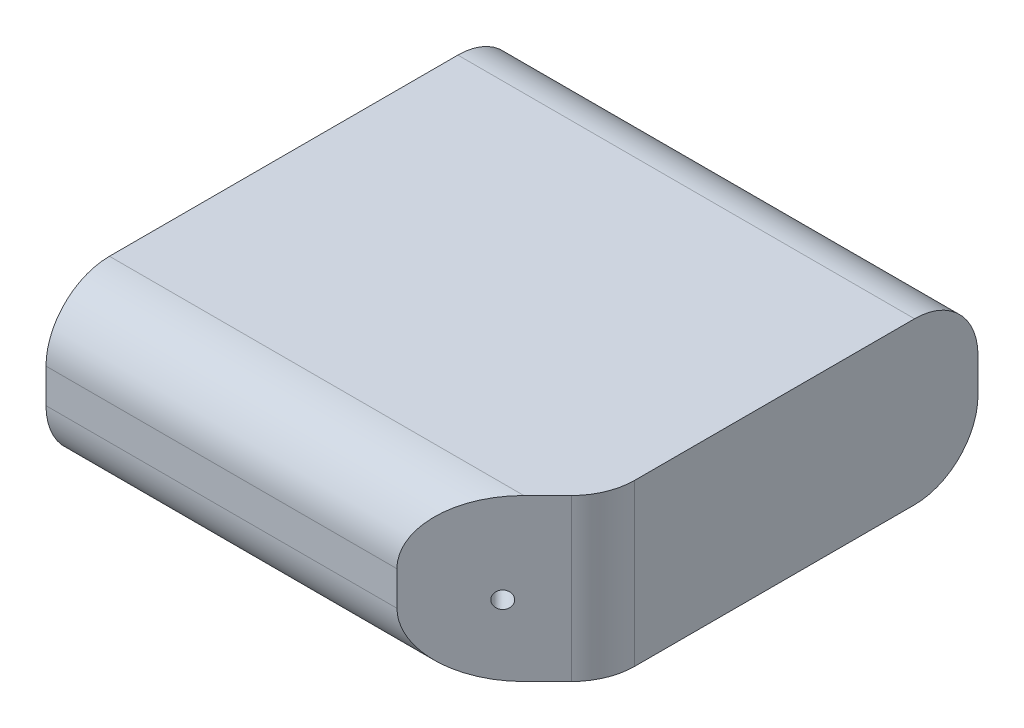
ISO-10303-21;
HEADER;
FILE_DESCRIPTION(('STEP AP214'),'2;1');
FILE_NAME('part.step','',(''),(''),'','','');
FILE_SCHEMA(('AUTOMOTIVE_DESIGN { 1 0 10303 214 1 1 1 1 }'));
ENDSEC;
DATA;
#1=APPLICATION_CONTEXT('core data for automotive mechanical design processes');
#2=APPLICATION_PROTOCOL_DEFINITION('international standard','automotive_design',2000,#1);
#3=PRODUCT_CONTEXT('',#1,'mechanical');
#4=PRODUCT('Part','Part','',(#3));
#5=PRODUCT_RELATED_PRODUCT_CATEGORY('part','',(#4));
#6=PRODUCT_DEFINITION_FORMATION('','',#4);
#7=PRODUCT_DEFINITION_CONTEXT('part definition',#1,'design');
#8=PRODUCT_DEFINITION('design','',#6,#7);
#9=PRODUCT_DEFINITION_SHAPE('','',#8);
#10=(LENGTH_UNIT() NAMED_UNIT(*) SI_UNIT(.MILLI.,.METRE.));
#11=(NAMED_UNIT(*) PLANE_ANGLE_UNIT() SI_UNIT($,.RADIAN.));
#12=(NAMED_UNIT(*) SI_UNIT($,.STERADIAN.) SOLID_ANGLE_UNIT());
#13=UNCERTAINTY_MEASURE_WITH_UNIT(LENGTH_MEASURE(1.E-05),#10,'distance_accuracy_value','');
#14=(GEOMETRIC_REPRESENTATION_CONTEXT(3) GLOBAL_UNCERTAINTY_ASSIGNED_CONTEXT((#13)) GLOBAL_UNIT_ASSIGNED_CONTEXT((#10,
#11,#12)) REPRESENTATION_CONTEXT('',''));
#15=CARTESIAN_POINT('',(0.,0.,0.));
#16=DIRECTION('',(0.,0.,1.));
#17=DIRECTION('',(1.,0.,0.));
#18=AXIS2_PLACEMENT_3D('',#15,#16,#17);
#19=CARTESIAN_POINT('',(-216.,0.,0.));
#20=DIRECTION('',(0.,0.,1.));
#21=DIRECTION('',(1.,0.,0.));
#22=AXIS2_PLACEMENT_3D('',#19,#20,#21);
#23=PLANE('',#22);
#24=DIRECTION('',(0.,-1.,0.));
#25=VECTOR('',#24,1.);
#26=CARTESIAN_POINT('',(-216.,0.,0.));
#27=LINE('',#26,#25);
#28=CARTESIAN_POINT('',(-216.,46.2,0.));
#29=VERTEX_POINT('',#28);
#30=CARTESIAN_POINT('',(-216.,30.,0.));
#31=VERTEX_POINT('',#30);
#32=EDGE_CURVE('E135',#29,#31,#27,.T.);
#33=ORIENTED_EDGE('',*,*,#32,.T.);
#34=DIRECTION('',(1.,0.,0.));
#35=VECTOR('',#34,1.);
#36=CARTESIAN_POINT('',(-216.,30.,0.));
#37=LINE('',#36,#35);
#38=CARTESIAN_POINT('',(-50.0000000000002,30.,0.));
#39=VERTEX_POINT('',#38);
#40=EDGE_CURVE('E11',#31,#39,#37,.T.);
#41=ORIENTED_EDGE('',*,*,#40,.T.);
#42=DIRECTION('',(0.,1.,0.));
#43=VECTOR('',#42,1.);
#44=CARTESIAN_POINT('',(-50.0000000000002,76.2,0.));
#45=LINE('',#44,#43);
#46=CARTESIAN_POINT('',(-50.0000000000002,46.2,0.));
#47=VERTEX_POINT('',#46);
#48=EDGE_CURVE('E196',#39,#47,#45,.T.);
#49=ORIENTED_EDGE('',*,*,#48,.T.);
#50=DIRECTION('',(1.,0.,0.));
#51=VECTOR('',#50,1.);
#52=CARTESIAN_POINT('',(-216.,46.2,0.));
#53=LINE('',#52,#51);
#54=EDGE_CURVE('E42',#47,#29,#53,.F.);
#55=ORIENTED_EDGE('',*,*,#54,.T.);
#56=EDGE_LOOP('',(#33,#41,#49,#55));
#57=FACE_BOUND('',#56,.T.);
#58=ADVANCED_FACE('F34',(#57),#23,.T.);
#59=CARTESIAN_POINT('',(-216.,76.2,0.));
#60=DIRECTION('',(0.,1.,0.));
#61=DIRECTION('',(0.,0.,1.));
#62=AXIS2_PLACEMENT_3D('',#59,#60,#61);
#63=PLANE('',#62);
#64=DIRECTION('',(0.707106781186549,0.,-0.707106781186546));
#65=VECTOR('',#64,1.);
#66=CARTESIAN_POINT('',(-133.,76.2,82.9999999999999));
#67=LINE('',#66,#65);
#68=CARTESIAN_POINT('',(-20.0000000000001,76.2,-30.));
#69=VERTEX_POINT('',#68);
#70=CARTESIAN_POINT('',(-8.78679656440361,76.2,-41.2132034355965));
#71=VERTEX_POINT('',#70);
#72=EDGE_CURVE('E125',#69,#71,#67,.T.);
#73=ORIENTED_EDGE('',*,*,#72,.T.);
#74=CARTESIAN_POINT('',(-30.,76.2,-62.4264068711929));
#75=DIRECTION('',(0.,1.,0.));
#76=DIRECTION('',(0.,0.,1.));
#77=AXIS2_PLACEMENT_3D('',#74,#75,#76);
#78=CIRCLE('',#77,30.);
#79=CARTESIAN_POINT('',(0.,76.2,-62.4264068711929));
#80=VERTEX_POINT('',#79);
#81=EDGE_CURVE('E134',#71,#80,#78,.T.);
#82=ORIENTED_EDGE('',*,*,#81,.T.);
#83=DIRECTION('',(0.,0.,1.));
#84=VECTOR('',#83,1.);
#85=CARTESIAN_POINT('',(0.,76.2,0.));
#86=LINE('',#85,#84);
#87=CARTESIAN_POINT('',(0.,76.2,-194.8));
#88=VERTEX_POINT('',#87);
#89=EDGE_CURVE('E116',#88,#80,#86,.T.);
#90=ORIENTED_EDGE('',*,*,#89,.F.);
#91=DIRECTION('',(1.,0.,0.));
#92=VECTOR('',#91,1.);
#93=CARTESIAN_POINT('',(-216.,76.2,-194.8));
#94=LINE('',#93,#92);
#95=CARTESIAN_POINT('',(-216.,76.2,-194.8));
#96=VERTEX_POINT('',#95);
#97=EDGE_CURVE('E131',#88,#96,#94,.F.);
#98=ORIENTED_EDGE('',*,*,#97,.T.);
#99=DIRECTION('',(0.,0.,1.));
#100=VECTOR('',#99,1.);
#101=CARTESIAN_POINT('',(-216.,76.2,0.));
#102=LINE('',#101,#100);
#103=CARTESIAN_POINT('',(-216.,76.2,-30.));
#104=VERTEX_POINT('',#103);
#105=EDGE_CURVE('E202',#96,#104,#102,.T.);
#106=ORIENTED_EDGE('',*,*,#105,.T.);
#107=DIRECTION('',(1.,0.,0.));
#108=VECTOR('',#107,1.);
#109=CARTESIAN_POINT('',(-216.,76.2,-30.));
#110=LINE('',#109,#108);
#111=EDGE_CURVE('E140',#104,#69,#110,.T.);
#112=ORIENTED_EDGE('',*,*,#111,.T.);
#113=EDGE_LOOP('',(#73,#82,#90,#98,#106,#112));
#114=FACE_BOUND('',#113,.T.);
#115=ADVANCED_FACE('F129',(#114),#63,.T.);
#116=CARTESIAN_POINT('',(-216.,0.,-224.8));
#117=DIRECTION('',(0.,0.,-1.));
#118=DIRECTION('',(-1.,0.,0.));
#119=AXIS2_PLACEMENT_3D('',#116,#117,#118);
#120=PLANE('',#119);
#121=DIRECTION('',(0.,1.,0.));
#122=VECTOR('',#121,1.);
#123=CARTESIAN_POINT('',(0.,0.,-224.8));
#124=LINE('',#123,#122);
#125=CARTESIAN_POINT('',(0.,30.,-224.8));
#126=VERTEX_POINT('',#125);
#127=CARTESIAN_POINT('',(0.,46.2,-224.8));
#128=VERTEX_POINT('',#127);
#129=EDGE_CURVE('E119',#126,#128,#124,.T.);
#130=ORIENTED_EDGE('',*,*,#129,.F.);
#131=DIRECTION('',(1.,0.,0.));
#132=VECTOR('',#131,1.);
#133=CARTESIAN_POINT('',(-216.,30.,-224.8));
#134=LINE('',#133,#132);
#135=CARTESIAN_POINT('',(-216.,30.,-224.8));
#136=VERTEX_POINT('',#135);
#137=EDGE_CURVE('E150',#126,#136,#134,.F.);
#138=ORIENTED_EDGE('',*,*,#137,.T.);
#139=DIRECTION('',(0.,1.,0.));
#140=VECTOR('',#139,1.);
#141=CARTESIAN_POINT('',(-216.,0.,-224.8));
#142=LINE('',#141,#140);
#143=CARTESIAN_POINT('',(-216.,46.2,-224.8));
#144=VERTEX_POINT('',#143);
#145=EDGE_CURVE('E163',#136,#144,#142,.T.);
#146=ORIENTED_EDGE('',*,*,#145,.T.);
#147=DIRECTION('',(1.,0.,0.));
#148=VECTOR('',#147,1.);
#149=CARTESIAN_POINT('',(-216.,46.2,-224.8));
#150=LINE('',#149,#148);
#151=EDGE_CURVE('E142',#144,#128,#150,.T.);
#152=ORIENTED_EDGE('',*,*,#151,.T.);
#153=EDGE_LOOP('',(#130,#138,#146,#152));
#154=FACE_BOUND('',#153,.T.);
#155=ADVANCED_FACE('F237',(#154),#120,.T.);
#156=CARTESIAN_POINT('',(-216.,0.,0.));
#157=DIRECTION('',(0.,-1.,0.));
#158=DIRECTION('',(0.,0.,-1.));
#159=AXIS2_PLACEMENT_3D('',#156,#157,#158);
#160=PLANE('',#159);
#161=DIRECTION('',(0.,0.,-1.));
#162=VECTOR('',#161,1.);
#163=CARTESIAN_POINT('',(0.,0.,0.));
#164=LINE('',#163,#162);
#165=CARTESIAN_POINT('',(0.,0.,-62.4264068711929));
#166=VERTEX_POINT('',#165);
#167=CARTESIAN_POINT('',(0.,0.,-194.8));
#168=VERTEX_POINT('',#167);
#169=EDGE_CURVE('E205',#166,#168,#164,.T.);
#170=ORIENTED_EDGE('',*,*,#169,.F.);
#171=CARTESIAN_POINT('',(-30.,0.,-62.4264068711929));
#172=DIRECTION('',(0.,-1.,0.));
#173=DIRECTION('',(0.,0.,-1.));
#174=AXIS2_PLACEMENT_3D('',#171,#172,#173);
#175=CIRCLE('',#174,30.);
#176=CARTESIAN_POINT('',(-8.78679656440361,0.,-41.2132034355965));
#177=VERTEX_POINT('',#176);
#178=EDGE_CURVE('E178',#166,#177,#175,.T.);
#179=ORIENTED_EDGE('',*,*,#178,.T.);
#180=DIRECTION('',(-0.707106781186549,0.,0.707106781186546));
#181=VECTOR('',#180,1.);
#182=CARTESIAN_POINT('',(-133.,0.,82.9999999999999));
#183=LINE('',#182,#181);
#184=CARTESIAN_POINT('',(-20.0000000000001,0.,-30.));
#185=VERTEX_POINT('',#184);
#186=EDGE_CURVE('E193',#177,#185,#183,.T.);
#187=ORIENTED_EDGE('',*,*,#186,.T.);
#188=DIRECTION('',(1.,0.,0.));
#189=VECTOR('',#188,1.);
#190=CARTESIAN_POINT('',(-216.,0.,-30.));
#191=LINE('',#190,#189);
#192=CARTESIAN_POINT('',(-216.,0.,-30.));
#193=VERTEX_POINT('',#192);
#194=EDGE_CURVE('E175',#185,#193,#191,.F.);
#195=ORIENTED_EDGE('',*,*,#194,.T.);
#196=DIRECTION('',(0.,0.,-1.));
#197=VECTOR('',#196,1.);
#198=CARTESIAN_POINT('',(-216.,0.,0.));
#199=LINE('',#198,#197);
#200=CARTESIAN_POINT('',(-216.,0.,-194.8));
#201=VERTEX_POINT('',#200);
#202=EDGE_CURVE('E161',#193,#201,#199,.T.);
#203=ORIENTED_EDGE('',*,*,#202,.T.);
#204=DIRECTION('',(1.,0.,0.));
#205=VECTOR('',#204,1.);
#206=CARTESIAN_POINT('',(-216.,0.,-194.8));
#207=LINE('',#206,#205);
#208=EDGE_CURVE('E171',#201,#168,#207,.T.);
#209=ORIENTED_EDGE('',*,*,#208,.T.);
#210=EDGE_LOOP('',(#170,#179,#187,#195,#203,#209));
#211=FACE_BOUND('',#210,.T.);
#212=ADVANCED_FACE('F170',(#211),#160,.T.);
#213=CARTESIAN_POINT('',(-216.,76.2,0.));
#214=DIRECTION('',(-1.,0.,0.));
#215=DIRECTION('',(0.,0.,1.));
#216=AXIS2_PLACEMENT_3D('',#213,#214,#215);
#217=PLANE('',#216);
#218=ORIENTED_EDGE('',*,*,#145,.F.);
#219=CARTESIAN_POINT('',(-216.,30.,-194.8));
#220=DIRECTION('',(-1.,0.,0.));
#221=DIRECTION('',(0.,0.,1.));
#222=AXIS2_PLACEMENT_3D('',#219,#220,#221);
#223=CIRCLE('',#222,30.);
#224=EDGE_CURVE('E156',#136,#201,#223,.T.);
#225=ORIENTED_EDGE('',*,*,#224,.T.);
#226=ORIENTED_EDGE('',*,*,#202,.F.);
#227=CARTESIAN_POINT('',(-216.,30.,-30.));
#228=DIRECTION('',(-1.,0.,0.));
#229=DIRECTION('',(0.,0.,1.));
#230=AXIS2_PLACEMENT_3D('',#227,#228,#229);
#231=CIRCLE('',#230,30.);
#232=EDGE_CURVE('E49',#193,#31,#231,.T.);
#233=ORIENTED_EDGE('',*,*,#232,.T.);
#234=ORIENTED_EDGE('',*,*,#32,.F.);
#235=CARTESIAN_POINT('',(-216.,46.2,-30.));
#236=DIRECTION('',(-1.,0.,0.));
#237=DIRECTION('',(0.,0.,1.));
#238=AXIS2_PLACEMENT_3D('',#235,#236,#237);
#239=CIRCLE('',#238,30.);
#240=EDGE_CURVE('E152',#29,#104,#239,.T.);
#241=ORIENTED_EDGE('',*,*,#240,.T.);
#242=ORIENTED_EDGE('',*,*,#105,.F.);
#243=CARTESIAN_POINT('',(-216.,46.2,-194.8));
#244=DIRECTION('',(-1.,0.,0.));
#245=DIRECTION('',(0.,0.,1.));
#246=AXIS2_PLACEMENT_3D('',#243,#244,#245);
#247=CIRCLE('',#246,30.);
#248=EDGE_CURVE('E139',#96,#144,#247,.T.);
#249=ORIENTED_EDGE('',*,*,#248,.T.);
#250=EDGE_LOOP('',(#218,#225,#226,#233,#234,#241,#242,#249));
#251=FACE_BOUND('',#250,.T.);
#252=ADVANCED_FACE('F160',(#251),#217,.T.);
#253=CARTESIAN_POINT('',(0.,76.2,0.));
#254=DIRECTION('',(-1.,0.,0.));
#255=DIRECTION('',(0.,0.,1.));
#256=AXIS2_PLACEMENT_3D('',#253,#254,#255);
#257=PLANE('',#256);
#258=ORIENTED_EDGE('',*,*,#89,.T.);
#259=DIRECTION('',(0.,-1.,0.));
#260=VECTOR('',#259,1.);
#261=CARTESIAN_POINT('',(0.,0.,-62.4264068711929));
#262=LINE('',#261,#260);
#263=EDGE_CURVE('E182',#80,#166,#262,.T.);
#264=ORIENTED_EDGE('',*,*,#263,.T.);
#265=ORIENTED_EDGE('',*,*,#169,.T.);
#266=CARTESIAN_POINT('',(0.,30.,-194.8));
#267=DIRECTION('',(-1.,0.,0.));
#268=DIRECTION('',(0.,0.,1.));
#269=AXIS2_PLACEMENT_3D('',#266,#267,#268);
#270=CIRCLE('',#269,30.);
#271=EDGE_CURVE('E124',#168,#126,#270,.F.);
#272=ORIENTED_EDGE('',*,*,#271,.T.);
#273=ORIENTED_EDGE('',*,*,#129,.T.);
#274=CARTESIAN_POINT('',(0.,46.2,-194.8));
#275=DIRECTION('',(-1.,0.,0.));
#276=DIRECTION('',(0.,0.,1.));
#277=AXIS2_PLACEMENT_3D('',#274,#275,#276);
#278=CIRCLE('',#277,30.);
#279=EDGE_CURVE('E112',#128,#88,#278,.F.);
#280=ORIENTED_EDGE('',*,*,#279,.T.);
#281=EDGE_LOOP('',(#258,#264,#265,#272,#273,#280));
#282=FACE_BOUND('',#281,.T.);
#283=ADVANCED_FACE('F114',(#282),#257,.F.);
#284=CARTESIAN_POINT('',(0.,76.2,-50.));
#285=DIRECTION('',(0.707106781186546,0.,0.707106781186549));
#286=DIRECTION('',(0.707106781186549,0.,-0.707106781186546));
#287=AXIS2_PLACEMENT_3D('',#284,#285,#286);
#288=PLANE('',#287);
#289=CARTESIAN_POINT('',(-25.,33.4987623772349,-25.0000000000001));
#290=DIRECTION('',(0.707106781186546,0.,0.707106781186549));
#291=DIRECTION('',(0.707106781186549,0.,-0.707106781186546));
#292=AXIS2_PLACEMENT_3D('',#289,#290,#291);
#293=CIRCLE('',#292,4.);
#294=CARTESIAN_POINT('',(-22.1715728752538,33.4987623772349,-27.8284271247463));
#295=VERTEX_POINT('',#294);
#296=EDGE_CURVE('E211',#295,#295,#293,.T.);
#297=ORIENTED_EDGE('',*,*,#296,.F.);
#298=EDGE_LOOP('',(#297));
#299=FACE_BOUND('',#298,.T.);
#300=ORIENTED_EDGE('',*,*,#186,.F.);
#301=DIRECTION('',(0.,-1.,0.));
#302=VECTOR('',#301,1.);
#303=CARTESIAN_POINT('',(-8.78679656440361,76.2,-41.2132034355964));
#304=LINE('',#303,#302);
#305=EDGE_CURVE('E145',#177,#71,#304,.F.);
#306=ORIENTED_EDGE('',*,*,#305,.T.);
#307=ORIENTED_EDGE('',*,*,#72,.F.);
#308=CARTESIAN_POINT('',(-20.0000000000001,46.2,-30.));
#309=DIRECTION('',(0.707106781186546,0.,0.707106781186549));
#310=DIRECTION('',(0.707106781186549,0.,-0.707106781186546));
#311=AXIS2_PLACEMENT_3D('',#308,#309,#310);
#312=ELLIPSE('',#311,42.4264068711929,30.);
#313=EDGE_CURVE('E180',#69,#47,#312,.T.);
#314=ORIENTED_EDGE('',*,*,#313,.T.);
#315=ORIENTED_EDGE('',*,*,#48,.F.);
#316=CARTESIAN_POINT('',(-20.0000000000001,30.,-30.));
#317=DIRECTION('',(0.707106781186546,0.,0.707106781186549));
#318=DIRECTION('',(0.707106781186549,0.,-0.707106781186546));
#319=AXIS2_PLACEMENT_3D('',#316,#317,#318);
#320=ELLIPSE('',#319,42.4264068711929,30.);
#321=EDGE_CURVE('E187',#39,#185,#320,.T.);
#322=ORIENTED_EDGE('',*,*,#321,.T.);
#323=EDGE_LOOP('',(#300,#306,#307,#314,#315,#322));
#324=FACE_BOUND('',#323,.T.);
#325=ADVANCED_FACE('F192',(#299,#324),#288,.T.);
#326=CARTESIAN_POINT('',(-39.1421356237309,33.4987623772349,-39.1421356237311));
#327=DIRECTION('',(0.707106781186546,0.,0.707106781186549));
#328=DIRECTION('',(0.707106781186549,0.,-0.707106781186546));
#329=AXIS2_PLACEMENT_3D('',#326,#327,#328);
#330=CYLINDRICAL_SURFACE('',#329,4.);
#331=CARTESIAN_POINT('',(-39.1421356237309,33.4987623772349,-39.1421356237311));
#332=DIRECTION('',(0.707106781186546,0.,0.707106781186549));
#333=DIRECTION('',(0.707106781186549,0.,-0.707106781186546));
#334=AXIS2_PLACEMENT_3D('',#331,#332,#333);
#335=CIRCLE('',#334,4.);
#336=CARTESIAN_POINT('',(-36.3137084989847,33.4987623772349,-41.9705627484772));
#337=VERTEX_POINT('',#336);
#338=EDGE_CURVE('E207',#337,#337,#335,.T.);
#339=ORIENTED_EDGE('',*,*,#338,.F.);
#340=EDGE_LOOP('',(#339));
#341=FACE_BOUND('',#340,.T.);
#342=ORIENTED_EDGE('',*,*,#296,.T.);
#343=EDGE_LOOP('',(#342));
#344=FACE_BOUND('',#343,.T.);
#345=ADVANCED_FACE('F219',(#341,#344),#330,.F.);
#346=CARTESIAN_POINT('',(-39.1421356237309,33.4987623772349,-39.1421356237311));
#347=DIRECTION('',(0.707106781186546,0.,0.707106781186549));
#348=DIRECTION('',(0.707106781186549,0.,-0.707106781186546));
#349=AXIS2_PLACEMENT_3D('',#346,#347,#348);
#350=PLANE('',#349);
#351=ORIENTED_EDGE('',*,*,#338,.T.);
#352=EDGE_LOOP('',(#351));
#353=FACE_BOUND('',#352,.T.);
#354=ADVANCED_FACE('F217',(#353),#350,.T.);
#355=CARTESIAN_POINT('',(-30.,76.2,-62.4264068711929));
#356=DIRECTION('',(0.,1.,0.));
#357=DIRECTION('',(0.,0.,1.));
#358=AXIS2_PLACEMENT_3D('',#355,#356,#357);
#359=CYLINDRICAL_SURFACE('',#358,30.);
#360=ORIENTED_EDGE('',*,*,#81,.F.);
#361=ORIENTED_EDGE('',*,*,#305,.F.);
#362=ORIENTED_EDGE('',*,*,#178,.F.);
#363=ORIENTED_EDGE('',*,*,#263,.F.);
#364=EDGE_LOOP('',(#360,#361,#362,#363));
#365=FACE_BOUND('',#364,.T.);
#366=ADVANCED_FACE('F198',(#365),#359,.T.);
#367=CARTESIAN_POINT('',(-216.,30.,-194.8));
#368=DIRECTION('',(1.,0.,0.));
#369=DIRECTION('',(0.,0.,-1.));
#370=AXIS2_PLACEMENT_3D('',#367,#368,#369);
#371=CYLINDRICAL_SURFACE('',#370,30.);
#372=ORIENTED_EDGE('',*,*,#224,.F.);
#373=ORIENTED_EDGE('',*,*,#137,.F.);
#374=ORIENTED_EDGE('',*,*,#271,.F.);
#375=ORIENTED_EDGE('',*,*,#208,.F.);
#376=EDGE_LOOP('',(#372,#373,#374,#375));
#377=FACE_BOUND('',#376,.T.);
#378=ADVANCED_FACE('F177',(#377),#371,.T.);
#379=CARTESIAN_POINT('',(-216.,46.2,-194.8));
#380=DIRECTION('',(1.,0.,0.));
#381=DIRECTION('',(0.,0.,-1.));
#382=AXIS2_PLACEMENT_3D('',#379,#380,#381);
#383=CYLINDRICAL_SURFACE('',#382,30.);
#384=ORIENTED_EDGE('',*,*,#248,.F.);
#385=ORIENTED_EDGE('',*,*,#97,.F.);
#386=ORIENTED_EDGE('',*,*,#279,.F.);
#387=ORIENTED_EDGE('',*,*,#151,.F.);
#388=EDGE_LOOP('',(#384,#385,#386,#387));
#389=FACE_BOUND('',#388,.T.);
#390=ADVANCED_FACE('F138',(#389),#383,.T.);
#391=CARTESIAN_POINT('',(-216.,30.,-30.));
#392=DIRECTION('',(1.,0.,0.));
#393=DIRECTION('',(0.,0.,-1.));
#394=AXIS2_PLACEMENT_3D('',#391,#392,#393);
#395=CYLINDRICAL_SURFACE('',#394,30.);
#396=ORIENTED_EDGE('',*,*,#232,.F.);
#397=ORIENTED_EDGE('',*,*,#194,.F.);
#398=ORIENTED_EDGE('',*,*,#321,.F.);
#399=ORIENTED_EDGE('',*,*,#40,.F.);
#400=EDGE_LOOP('',(#396,#397,#398,#399));
#401=FACE_BOUND('',#400,.T.);
#402=ADVANCED_FACE('F257',(#401),#395,.T.);
#403=CARTESIAN_POINT('',(-216.,46.2,-30.));
#404=DIRECTION('',(1.,0.,0.));
#405=DIRECTION('',(0.,0.,-1.));
#406=AXIS2_PLACEMENT_3D('',#403,#404,#405);
#407=CYLINDRICAL_SURFACE('',#406,30.);
#408=ORIENTED_EDGE('',*,*,#240,.F.);
#409=ORIENTED_EDGE('',*,*,#54,.F.);
#410=ORIENTED_EDGE('',*,*,#313,.F.);
#411=ORIENTED_EDGE('',*,*,#111,.F.);
#412=EDGE_LOOP('',(#408,#409,#410,#411));
#413=FACE_BOUND('',#412,.T.);
#414=ADVANCED_FACE('F36',(#413),#407,.T.);
#415=CLOSED_SHELL('',(#58,#115,#155,#212,#252,#283,#325,#345,#354,#366,#378,#390,#402,#414));
#416=MANIFOLD_SOLID_BREP('B2',#415);
#417=ADVANCED_BREP_SHAPE_REPRESENTATION('',(#18,#416),#14);
#418=SHAPE_DEFINITION_REPRESENTATION(#9,#417);
ENDSEC;
END-ISO-10303-21;
